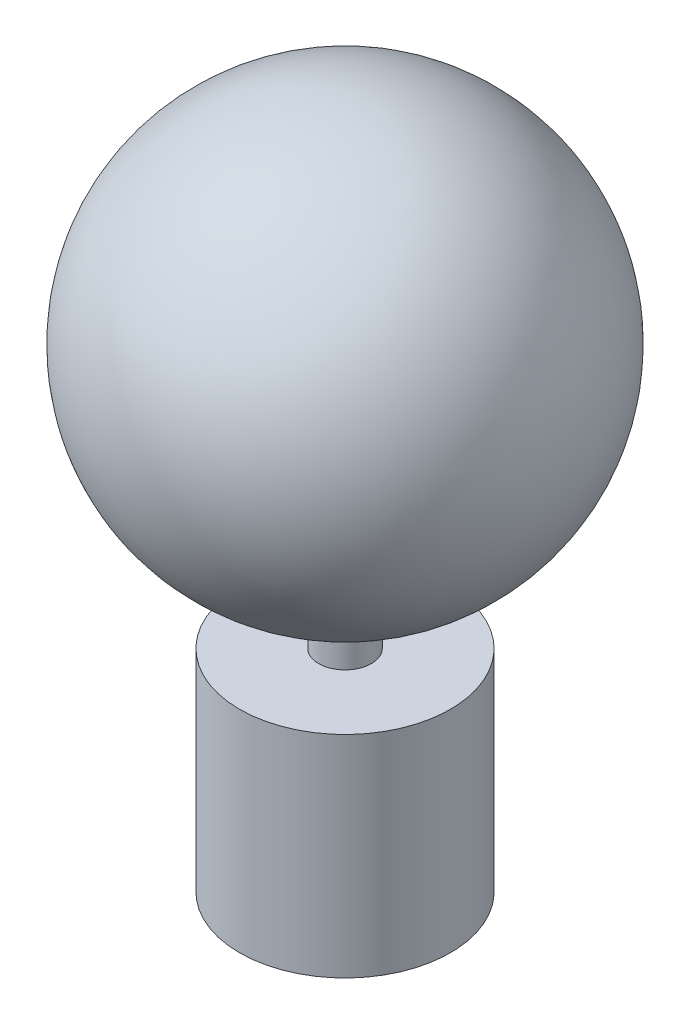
from build123d import *

# Parameters (mm, degrees)
SKETCH1_R           = 12.7
BOSS_EXTRUDE1_DEPTH = 25.4
SKETCH2_R           = 3.175
BOSS_EXTRUDE2_DEPTH = 6.35


with BuildPart() as part:
    # Sketch1 → Boss-Extrude1 (new body)
    with BuildSketch(Plane(origin=(0, 0, 0), x_dir=(1, 0, 0), z_dir=(0, 1, 0))):
        with Locations(Location((0, 0, 0), (0, 0, 270))):
            Circle(SKETCH1_R)
    extrude(amount=-BOSS_EXTRUDE1_DEPTH)

    # Sketch2 → Boss-Extrude2 (add)
    with BuildSketch(Plane(origin=(0, 0, 0), x_dir=(1, 0, 0), z_dir=(0, 1, 0))):
        with Locations(Location((0, 0, 0), (0, 0, 270))):
            Circle(SKETCH2_R)
    extrude(amount=BOSS_EXTRUDE2_DEPTH)


with BuildPart() as body_2:
    # Sketch3 → Revolve4 (revolve)
    with BuildSketch(Plane(origin=(0, 31.75, 0), x_dir=(1, 0, 0), z_dir=(0, 1, 0))):
        with BuildLine():
            Line((0, 25.4), (0, -25.4))
            ThreePointArc((0, -25.4), (25.4, 0), (0, 25.4))
        make_face()
    revolve(axis=Axis((0, 31.75, -25.4), (0, 0, 1)))


solid = Compound([part.part, body_2.part])
